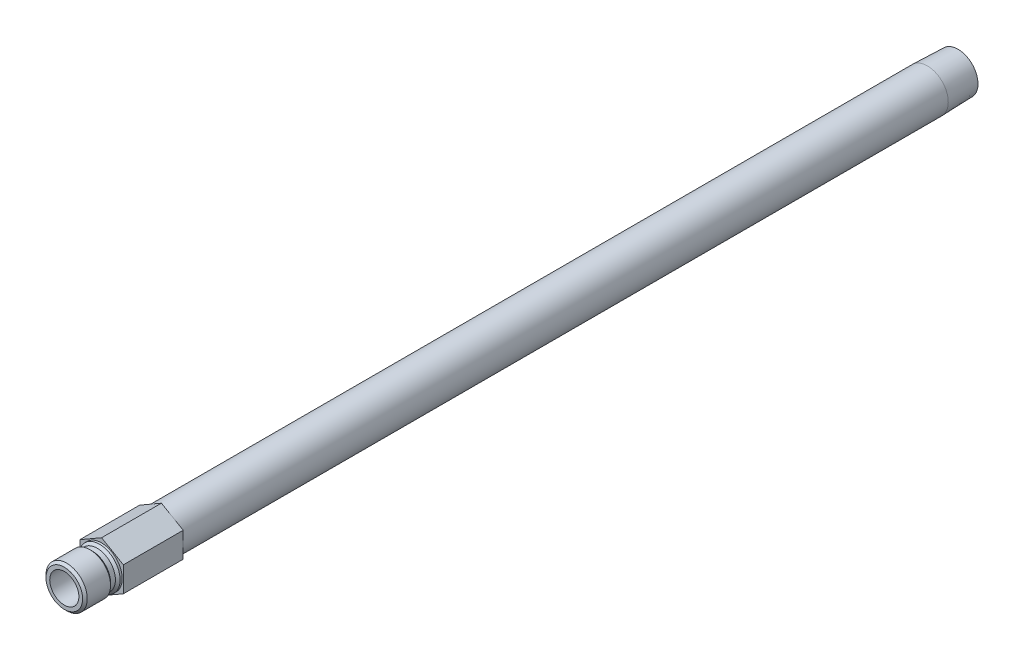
ISO-10303-21;
HEADER;
FILE_DESCRIPTION(('STEP AP214'),'2;1');
FILE_NAME('part.step','',(''),(''),'','','');
FILE_SCHEMA(('AUTOMOTIVE_DESIGN { 1 0 10303 214 1 1 1 1 }'));
ENDSEC;
DATA;
#1=APPLICATION_CONTEXT('core data for automotive mechanical design processes');
#2=APPLICATION_PROTOCOL_DEFINITION('international standard','automotive_design',2000,#1);
#3=PRODUCT_CONTEXT('',#1,'mechanical');
#4=PRODUCT('Part','Part','',(#3));
#5=PRODUCT_RELATED_PRODUCT_CATEGORY('part','',(#4));
#6=PRODUCT_DEFINITION_FORMATION('','',#4);
#7=PRODUCT_DEFINITION_CONTEXT('part definition',#1,'design');
#8=PRODUCT_DEFINITION('design','',#6,#7);
#9=PRODUCT_DEFINITION_SHAPE('','',#8);
#10=(LENGTH_UNIT() NAMED_UNIT(*) SI_UNIT(.MILLI.,.METRE.));
#11=(NAMED_UNIT(*) PLANE_ANGLE_UNIT() SI_UNIT($,.RADIAN.));
#12=(NAMED_UNIT(*) SI_UNIT($,.STERADIAN.) SOLID_ANGLE_UNIT());
#13=UNCERTAINTY_MEASURE_WITH_UNIT(LENGTH_MEASURE(1.E-05),#10,'distance_accuracy_value','');
#14=(GEOMETRIC_REPRESENTATION_CONTEXT(3) GLOBAL_UNCERTAINTY_ASSIGNED_CONTEXT((#13)) GLOBAL_UNIT_ASSIGNED_CONTEXT((#10,
#11,#12)) REPRESENTATION_CONTEXT('',''));
#15=CARTESIAN_POINT('',(0.,0.,0.));
#16=DIRECTION('',(0.,0.,1.));
#17=DIRECTION('',(1.,0.,0.));
#18=AXIS2_PLACEMENT_3D('',#15,#16,#17);
#19=CARTESIAN_POINT('',(0.,0.,0.));
#20=DIRECTION('',(0.,0.,-1.));
#21=DIRECTION('',(0.,1.,0.));
#22=AXIS2_PLACEMENT_3D('',#19,#20,#21);
#23=CYLINDRICAL_SURFACE('',#22,4.7625);
#24=CARTESIAN_POINT('',(0.,0.,0.));
#25=DIRECTION('',(0.,0.,1.));
#26=DIRECTION('',(1.,0.,0.));
#27=AXIS2_PLACEMENT_3D('',#24,#25,#26);
#28=CIRCLE('',#27,4.7625);
#29=CARTESIAN_POINT('',(4.7625,0.,0.));
#30=VERTEX_POINT('',#29);
#31=EDGE_CURVE('E138',#30,#30,#28,.T.);
#32=ORIENTED_EDGE('',*,*,#31,.F.);
#33=EDGE_LOOP('',(#32));
#34=FACE_BOUND('',#33,.T.);
#35=CARTESIAN_POINT('',(0.,0.,12.192));
#36=DIRECTION('',(0.,0.,-1.));
#37=DIRECTION('',(0.,1.,0.));
#38=AXIS2_PLACEMENT_3D('',#35,#36,#37);
#39=CIRCLE('',#38,4.7625);
#40=CARTESIAN_POINT('',(0.,4.7625,12.192));
#41=VERTEX_POINT('',#40);
#42=EDGE_CURVE('E11',#41,#41,#39,.T.);
#43=ORIENTED_EDGE('',*,*,#42,.F.);
#44=EDGE_LOOP('',(#43));
#45=FACE_BOUND('',#44,.T.);
#46=ADVANCED_FACE('F33',(#34,#45),#23,.F.);
#47=CARTESIAN_POINT('',(0.,4.7625,12.192));
#48=DIRECTION('',(0.,0.,1.));
#49=DIRECTION('',(0.,-1.,0.));
#50=AXIS2_PLACEMENT_3D('',#47,#48,#49);
#51=PLANE('',#50);
#52=ORIENTED_EDGE('',*,*,#42,.T.);
#53=EDGE_LOOP('',(#52));
#54=FACE_BOUND('',#53,.T.);
#55=CARTESIAN_POINT('',(0.,0.,12.192));
#56=DIRECTION('',(0.,0.,-1.));
#57=DIRECTION('',(0.,1.,0.));
#58=AXIS2_PLACEMENT_3D('',#55,#56,#57);
#59=CIRCLE('',#58,5.9817);
#60=CARTESIAN_POINT('',(0.,5.9817,12.192));
#61=VERTEX_POINT('',#60);
#62=EDGE_CURVE('E41',#61,#61,#59,.T.);
#63=ORIENTED_EDGE('',*,*,#62,.F.);
#64=EDGE_LOOP('',(#63));
#65=FACE_BOUND('',#64,.T.);
#66=ADVANCED_FACE('F181',(#54,#65),#51,.T.);
#67=CARTESIAN_POINT('',(0.,0.,11.43));
#68=DIRECTION('',(0.,0.,-1.));
#69=DIRECTION('',(0.,1.,0.));
#70=AXIS2_PLACEMENT_3D('',#67,#68,#69);
#71=CONICAL_SURFACE('',#70,6.7437,0.785398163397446);
#72=ORIENTED_EDGE('',*,*,#62,.T.);
#73=EDGE_LOOP('',(#72));
#74=FACE_BOUND('',#73,.T.);
#75=CARTESIAN_POINT('',(0.,0.,11.43));
#76=DIRECTION('',(0.,0.,-1.));
#77=DIRECTION('',(0.,1.,0.));
#78=AXIS2_PLACEMENT_3D('',#75,#76,#77);
#79=CIRCLE('',#78,6.7437);
#80=CARTESIAN_POINT('',(0.,6.7437,11.43));
#81=VERTEX_POINT('',#80);
#82=EDGE_CURVE('E173',#81,#81,#79,.T.);
#83=ORIENTED_EDGE('',*,*,#82,.F.);
#84=EDGE_LOOP('',(#83));
#85=FACE_BOUND('',#84,.T.);
#86=ADVANCED_FACE('F178',(#74,#85),#71,.T.);
#87=CARTESIAN_POINT('',(0.,0.,0.));
#88=DIRECTION('',(0.,0.,-1.));
#89=DIRECTION('',(0.,1.,0.));
#90=AXIS2_PLACEMENT_3D('',#87,#88,#89);
#91=CYLINDRICAL_SURFACE('',#90,6.7437);
#92=ORIENTED_EDGE('',*,*,#82,.T.);
#93=EDGE_LOOP('',(#92));
#94=FACE_BOUND('',#93,.T.);
#95=CARTESIAN_POINT('',(0.,0.,3.81));
#96=DIRECTION('',(0.,0.,-1.));
#97=DIRECTION('',(0.,1.,0.));
#98=AXIS2_PLACEMENT_3D('',#95,#96,#97);
#99=CIRCLE('',#98,6.7437);
#100=CARTESIAN_POINT('',(0.,6.7437,3.81));
#101=VERTEX_POINT('',#100);
#102=EDGE_CURVE('E170',#101,#101,#99,.T.);
#103=ORIENTED_EDGE('',*,*,#102,.F.);
#104=EDGE_LOOP('',(#103));
#105=FACE_BOUND('',#104,.T.);
#106=ADVANCED_FACE('F188',(#94,#105),#91,.T.);
#107=CARTESIAN_POINT('',(0.,0.,3.048));
#108=DIRECTION('',(0.,0.,1.));
#109=DIRECTION('',(0.,-1.,0.));
#110=AXIS2_PLACEMENT_3D('',#107,#108,#109);
#111=CONICAL_SURFACE('',#110,5.9817,0.785398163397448);
#112=ORIENTED_EDGE('',*,*,#102,.T.);
#113=EDGE_LOOP('',(#112));
#114=FACE_BOUND('',#113,.T.);
#115=CARTESIAN_POINT('',(0.,0.,3.048));
#116=DIRECTION('',(0.,0.,-1.));
#117=DIRECTION('',(0.,1.,0.));
#118=AXIS2_PLACEMENT_3D('',#115,#116,#117);
#119=CIRCLE('',#118,5.9817);
#120=CARTESIAN_POINT('',(0.,5.9817,3.048));
#121=VERTEX_POINT('',#120);
#122=EDGE_CURVE('E167',#121,#121,#119,.T.);
#123=ORIENTED_EDGE('',*,*,#122,.F.);
#124=EDGE_LOOP('',(#123));
#125=FACE_BOUND('',#124,.T.);
#126=ADVANCED_FACE('F194',(#114,#125),#111,.T.);
#127=CARTESIAN_POINT('',(0.,0.,0.));
#128=DIRECTION('',(0.,0.,-1.));
#129=DIRECTION('',(0.,1.,0.));
#130=AXIS2_PLACEMENT_3D('',#127,#128,#129);
#131=CYLINDRICAL_SURFACE('',#130,5.9817);
#132=ORIENTED_EDGE('',*,*,#122,.T.);
#133=EDGE_LOOP('',(#132));
#134=FACE_BOUND('',#133,.T.);
#135=CARTESIAN_POINT('',(0.,0.,1.4605));
#136=DIRECTION('',(0.,0.,-1.));
#137=DIRECTION('',(0.,1.,0.));
#138=AXIS2_PLACEMENT_3D('',#135,#136,#137);
#139=CIRCLE('',#138,5.9817);
#140=CARTESIAN_POINT('',(0.,5.9817,1.4605));
#141=VERTEX_POINT('',#140);
#142=EDGE_CURVE('E164',#141,#141,#139,.T.);
#143=ORIENTED_EDGE('',*,*,#142,.F.);
#144=EDGE_LOOP('',(#143));
#145=FACE_BOUND('',#144,.T.);
#146=ADVANCED_FACE('F198',(#134,#145),#131,.T.);
#147=CARTESIAN_POINT('',(0.,0.,0.698499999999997));
#148=DIRECTION('',(0.,0.,-1.));
#149=DIRECTION('',(0.,1.,0.));
#150=AXIS2_PLACEMENT_3D('',#147,#148,#149);
#151=CONICAL_SURFACE('',#150,6.7437,0.785398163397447);
#152=ORIENTED_EDGE('',*,*,#142,.T.);
#153=EDGE_LOOP('',(#152));
#154=FACE_BOUND('',#153,.T.);
#155=CARTESIAN_POINT('',(0.,0.,0.698499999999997));
#156=DIRECTION('',(0.,0.,-1.));
#157=DIRECTION('',(0.,1.,0.));
#158=AXIS2_PLACEMENT_3D('',#155,#156,#157);
#159=CIRCLE('',#158,6.7437);
#160=CARTESIAN_POINT('',(0.,6.7437,0.698499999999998));
#161=VERTEX_POINT('',#160);
#162=EDGE_CURVE('E161',#161,#161,#159,.T.);
#163=ORIENTED_EDGE('',*,*,#162,.F.);
#164=EDGE_LOOP('',(#163));
#165=FACE_BOUND('',#164,.T.);
#166=ADVANCED_FACE('F202',(#154,#165),#151,.T.);
#167=CARTESIAN_POINT('',(0.,0.,0.));
#168=DIRECTION('',(0.,0.,-1.));
#169=DIRECTION('',(0.,1.,0.));
#170=AXIS2_PLACEMENT_3D('',#167,#168,#169);
#171=CYLINDRICAL_SURFACE('',#170,6.7437);
#172=ORIENTED_EDGE('',*,*,#162,.T.);
#173=EDGE_LOOP('',(#172));
#174=FACE_BOUND('',#173,.T.);
#175=CARTESIAN_POINT('',(0.,0.,0.));
#176=DIRECTION('',(0.,0.,-1.));
#177=DIRECTION('',(0.,1.,0.));
#178=AXIS2_PLACEMENT_3D('',#175,#176,#177);
#179=CIRCLE('',#178,6.7437);
#180=CARTESIAN_POINT('',(0.,6.7437,0.));
#181=VERTEX_POINT('',#180);
#182=EDGE_CURVE('E158',#181,#181,#179,.T.);
#183=ORIENTED_EDGE('',*,*,#182,.F.);
#184=EDGE_LOOP('',(#183));
#185=FACE_BOUND('',#184,.T.);
#186=ADVANCED_FACE('F206',(#174,#185),#171,.T.);
#187=CARTESIAN_POINT('',(0.,6.7437,0.));
#188=DIRECTION('',(0.,0.,1.));
#189=DIRECTION('',(0.,-1.,0.));
#190=AXIS2_PLACEMENT_3D('',#187,#188,#189);
#191=PLANE('',#190);
#192=ORIENTED_EDGE('',*,*,#182,.T.);
#193=EDGE_LOOP('',(#192));
#194=FACE_BOUND('',#193,.T.);
#195=DIRECTION('',(-0.866025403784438,-0.5,0.));
#196=VECTOR('',#195,1.);
#197=CARTESIAN_POINT('',(0.,8.21223022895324,0.));
#198=LINE('',#197,#196);
#199=CARTESIAN_POINT('',(0.,8.21223022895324,0.));
#200=VERTEX_POINT('',#199);
#201=CARTESIAN_POINT('',(-7.112,4.10611511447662,0.));
#202=VERTEX_POINT('',#201);
#203=EDGE_CURVE('E120',#200,#202,#198,.T.);
#204=ORIENTED_EDGE('',*,*,#203,.T.);
#205=DIRECTION('',(0.,-1.,0.));
#206=VECTOR('',#205,1.);
#207=CARTESIAN_POINT('',(-7.112,4.10611511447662,0.));
#208=LINE('',#207,#206);
#209=CARTESIAN_POINT('',(-7.112,-4.10611511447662,0.));
#210=VERTEX_POINT('',#209);
#211=EDGE_CURVE('E123',#202,#210,#208,.T.);
#212=ORIENTED_EDGE('',*,*,#211,.T.);
#213=DIRECTION('',(0.866025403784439,-0.5,0.));
#214=VECTOR('',#213,1.);
#215=CARTESIAN_POINT('',(-7.112,-4.10611511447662,0.));
#216=LINE('',#215,#214);
#217=CARTESIAN_POINT('',(0.,-8.21223022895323,0.));
#218=VERTEX_POINT('',#217);
#219=EDGE_CURVE('E127',#210,#218,#216,.T.);
#220=ORIENTED_EDGE('',*,*,#219,.T.);
#221=DIRECTION('',(0.866025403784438,0.5,0.));
#222=VECTOR('',#221,1.);
#223=CARTESIAN_POINT('',(0.,-8.21223022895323,0.));
#224=LINE('',#223,#222);
#225=CARTESIAN_POINT('',(7.112,-4.10611511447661,0.));
#226=VERTEX_POINT('',#225);
#227=EDGE_CURVE('E130',#218,#226,#224,.T.);
#228=ORIENTED_EDGE('',*,*,#227,.T.);
#229=DIRECTION('',(0.,1.,0.));
#230=VECTOR('',#229,1.);
#231=CARTESIAN_POINT('',(7.112,-4.10611511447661,0.));
#232=LINE('',#231,#230);
#233=CARTESIAN_POINT('',(7.112,4.10611511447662,0.));
#234=VERTEX_POINT('',#233);
#235=EDGE_CURVE('E97',#226,#234,#232,.T.);
#236=ORIENTED_EDGE('',*,*,#235,.T.);
#237=DIRECTION('',(-0.866025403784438,0.5,0.));
#238=VECTOR('',#237,1.);
#239=CARTESIAN_POINT('',(7.112,4.10611511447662,0.));
#240=LINE('',#239,#238);
#241=EDGE_CURVE('E133',#234,#200,#240,.T.);
#242=ORIENTED_EDGE('',*,*,#241,.T.);
#243=EDGE_LOOP('',(#204,#212,#220,#228,#236,#242));
#244=FACE_BOUND('',#243,.T.);
#245=ADVANCED_FACE('F210',(#194,#244),#191,.T.);
#246=CARTESIAN_POINT('',(-7.112,4.10611511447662,0.));
#247=DIRECTION('',(0.,0.,1.));
#248=DIRECTION('',(1.,0.,0.));
#249=AXIS2_PLACEMENT_3D('',#246,#247,#248);
#250=PLANE('',#249);
#251=ORIENTED_EDGE('',*,*,#31,.T.);
#252=EDGE_LOOP('',(#251));
#253=FACE_BOUND('',#252,.T.);
#254=CARTESIAN_POINT('',(0.,0.,0.));
#255=DIRECTION('',(0.,0.,1.));
#256=DIRECTION('',(1.,0.,0.));
#257=AXIS2_PLACEMENT_3D('',#254,#255,#256);
#258=CIRCLE('',#257,4.62279999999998);
#259=CARTESIAN_POINT('',(4.62279999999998,0.,0.));
#260=VERTEX_POINT('',#259);
#261=EDGE_CURVE('E124',#260,#260,#258,.T.);
#262=ORIENTED_EDGE('',*,*,#261,.F.);
#263=EDGE_LOOP('',(#262));
#264=FACE_BOUND('',#263,.T.);
#265=ADVANCED_FACE('F214',(#253,#264),#250,.T.);
#266=CARTESIAN_POINT('',(0.,0.,-279.908));
#267=DIRECTION('',(0.,0.,1.));
#268=DIRECTION('',(0.,-1.,0.));
#269=AXIS2_PLACEMENT_3D('',#266,#267,#268);
#270=CONICAL_SURFACE('',#269,6.54447060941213,0.0312396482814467);
#271=CARTESIAN_POINT('',(0.,0.,-269.875));
#272=DIRECTION('',(0.,0.,-1.));
#273=DIRECTION('',(0.,1.,0.));
#274=AXIS2_PLACEMENT_3D('',#271,#272,#273);
#275=CIRCLE('',#274,6.85799999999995);
#276=CARTESIAN_POINT('',(0.,6.858,-269.875));
#277=VERTEX_POINT('',#276);
#278=EDGE_CURVE('E155',#277,#277,#275,.T.);
#279=ORIENTED_EDGE('',*,*,#278,.T.);
#280=EDGE_LOOP('',(#279));
#281=FACE_BOUND('',#280,.T.);
#282=CARTESIAN_POINT('',(0.,0.,-279.908));
#283=DIRECTION('',(0.,0.,-1.));
#284=DIRECTION('',(0.,1.,0.));
#285=AXIS2_PLACEMENT_3D('',#282,#283,#284);
#286=CIRCLE('',#285,6.54447060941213);
#287=CARTESIAN_POINT('',(0.,6.54447060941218,-279.908));
#288=VERTEX_POINT('',#287);
#289=EDGE_CURVE('E152',#288,#288,#286,.T.);
#290=ORIENTED_EDGE('',*,*,#289,.F.);
#291=EDGE_LOOP('',(#290));
#292=FACE_BOUND('',#291,.T.);
#293=ADVANCED_FACE('F220',(#281,#292),#270,.T.);
#294=CARTESIAN_POINT('',(0.,0.,0.));
#295=DIRECTION('',(0.,0.,-1.));
#296=DIRECTION('',(0.,1.,0.));
#297=AXIS2_PLACEMENT_3D('',#294,#295,#296);
#298=CYLINDRICAL_SURFACE('',#297,6.85799999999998);
#299=ORIENTED_EDGE('',*,*,#278,.F.);
#300=EDGE_LOOP('',(#299));
#301=FACE_BOUND('',#300,.T.);
#302=CARTESIAN_POINT('',(0.,0.,-19.558));
#303=DIRECTION('',(0.,0.,1.));
#304=DIRECTION('',(1.,0.,0.));
#305=AXIS2_PLACEMENT_3D('',#302,#303,#304);
#306=CIRCLE('',#305,6.85799999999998);
#307=CARTESIAN_POINT('',(6.85799999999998,0.,-19.558));
#308=VERTEX_POINT('',#307);
#309=EDGE_CURVE('E146',#308,#308,#306,.F.);
#310=ORIENTED_EDGE('',*,*,#309,.T.);
#311=EDGE_LOOP('',(#310));
#312=FACE_BOUND('',#311,.T.);
#313=ADVANCED_FACE('F216',(#301,#312),#298,.T.);
#314=CARTESIAN_POINT('',(0.,6.54447060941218,-279.908));
#315=DIRECTION('',(0.,0.,-1.));
#316=DIRECTION('',(0.,1.,0.));
#317=AXIS2_PLACEMENT_3D('',#314,#315,#316);
#318=PLANE('',#317);
#319=ORIENTED_EDGE('',*,*,#289,.T.);
#320=EDGE_LOOP('',(#319));
#321=FACE_BOUND('',#320,.T.);
#322=CARTESIAN_POINT('',(0.,0.,-279.908));
#323=DIRECTION('',(0.,0.,-1.));
#324=DIRECTION('',(0.,1.,0.));
#325=AXIS2_PLACEMENT_3D('',#322,#323,#324);
#326=CIRCLE('',#325,4.62279999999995);
#327=CARTESIAN_POINT('',(0.,4.6228,-279.908));
#328=VERTEX_POINT('',#327);
#329=EDGE_CURVE('E149',#328,#328,#326,.T.);
#330=ORIENTED_EDGE('',*,*,#329,.F.);
#331=EDGE_LOOP('',(#330));
#332=FACE_BOUND('',#331,.T.);
#333=ADVANCED_FACE('F219',(#321,#332),#318,.T.);
#334=CARTESIAN_POINT('',(0.,0.,0.));
#335=DIRECTION('',(0.,0.,-1.));
#336=DIRECTION('',(0.,1.,0.));
#337=AXIS2_PLACEMENT_3D('',#334,#335,#336);
#338=CYLINDRICAL_SURFACE('',#337,4.62279999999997);
#339=ORIENTED_EDGE('',*,*,#261,.T.);
#340=EDGE_LOOP('',(#339));
#341=FACE_BOUND('',#340,.T.);
#342=ORIENTED_EDGE('',*,*,#329,.T.);
#343=EDGE_LOOP('',(#342));
#344=FACE_BOUND('',#343,.T.);
#345=ADVANCED_FACE('F227',(#341,#344),#338,.F.);
#346=CARTESIAN_POINT('',(0.,8.21223022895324,-19.558));
#347=DIRECTION('',(-0.5,0.866025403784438,0.));
#348=DIRECTION('',(-0.866025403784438,-0.5,0.));
#349=AXIS2_PLACEMENT_3D('',#346,#347,#348);
#350=PLANE('',#349);
#351=ORIENTED_EDGE('',*,*,#203,.F.);
#352=DIRECTION('',(0.,0.,1.));
#353=VECTOR('',#352,1.);
#354=CARTESIAN_POINT('',(0.,8.21223022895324,-19.558));
#355=LINE('',#354,#353);
#356=CARTESIAN_POINT('',(0.,8.21223022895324,-19.558));
#357=VERTEX_POINT('',#356);
#358=EDGE_CURVE('E49',#357,#200,#355,.T.);
#359=ORIENTED_EDGE('',*,*,#358,.F.);
#360=DIRECTION('',(-0.866025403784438,-0.5,0.));
#361=VECTOR('',#360,1.);
#362=CARTESIAN_POINT('',(0.,8.21223022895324,-19.558));
#363=LINE('',#362,#361);
#364=CARTESIAN_POINT('',(-7.112,4.10611511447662,-19.558));
#365=VERTEX_POINT('',#364);
#366=EDGE_CURVE('E136',#357,#365,#363,.T.);
#367=ORIENTED_EDGE('',*,*,#366,.T.);
#368=DIRECTION('',(0.,0.,1.));
#369=VECTOR('',#368,1.);
#370=CARTESIAN_POINT('',(-7.112,4.10611511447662,-19.558));
#371=LINE('',#370,#369);
#372=EDGE_CURVE('E84',#365,#202,#371,.T.);
#373=ORIENTED_EDGE('',*,*,#372,.T.);
#374=EDGE_LOOP('',(#351,#359,#367,#373));
#375=FACE_BOUND('',#374,.T.);
#376=ADVANCED_FACE('F231',(#375),#350,.T.);
#377=CARTESIAN_POINT('',(7.112,4.10611511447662,-19.558));
#378=DIRECTION('',(0.5,0.866025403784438,0.));
#379=DIRECTION('',(-0.866025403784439,0.5,0.));
#380=AXIS2_PLACEMENT_3D('',#377,#378,#379);
#381=PLANE('',#380);
#382=ORIENTED_EDGE('',*,*,#241,.F.);
#383=DIRECTION('',(0.,0.,1.));
#384=VECTOR('',#383,1.);
#385=CARTESIAN_POINT('',(7.112,4.10611511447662,-19.558));
#386=LINE('',#385,#384);
#387=CARTESIAN_POINT('',(7.112,4.10611511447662,-19.558));
#388=VERTEX_POINT('',#387);
#389=EDGE_CURVE('E72',#388,#234,#386,.T.);
#390=ORIENTED_EDGE('',*,*,#389,.F.);
#391=DIRECTION('',(-0.866025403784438,0.5,0.));
#392=VECTOR('',#391,1.);
#393=CARTESIAN_POINT('',(7.112,4.10611511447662,-19.558));
#394=LINE('',#393,#392);
#395=EDGE_CURVE('E110',#388,#357,#394,.T.);
#396=ORIENTED_EDGE('',*,*,#395,.T.);
#397=ORIENTED_EDGE('',*,*,#358,.T.);
#398=EDGE_LOOP('',(#382,#390,#396,#397));
#399=FACE_BOUND('',#398,.T.);
#400=ADVANCED_FACE('F235',(#399),#381,.T.);
#401=CARTESIAN_POINT('',(7.112,-4.10611511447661,-19.558));
#402=DIRECTION('',(1.,0.,0.));
#403=DIRECTION('',(0.,1.,0.));
#404=AXIS2_PLACEMENT_3D('',#401,#402,#403);
#405=PLANE('',#404);
#406=ORIENTED_EDGE('',*,*,#235,.F.);
#407=DIRECTION('',(0.,0.,1.));
#408=VECTOR('',#407,1.);
#409=CARTESIAN_POINT('',(7.112,-4.10611511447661,-19.558));
#410=LINE('',#409,#408);
#411=CARTESIAN_POINT('',(7.112,-4.10611511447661,-19.558));
#412=VERTEX_POINT('',#411);
#413=EDGE_CURVE('E92',#412,#226,#410,.T.);
#414=ORIENTED_EDGE('',*,*,#413,.F.);
#415=DIRECTION('',(0.,1.,0.));
#416=VECTOR('',#415,1.);
#417=CARTESIAN_POINT('',(7.112,-4.10611511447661,-19.558));
#418=LINE('',#417,#416);
#419=EDGE_CURVE('E95',#412,#388,#418,.T.);
#420=ORIENTED_EDGE('',*,*,#419,.T.);
#421=ORIENTED_EDGE('',*,*,#389,.T.);
#422=EDGE_LOOP('',(#406,#414,#420,#421));
#423=FACE_BOUND('',#422,.T.);
#424=ADVANCED_FACE('F94',(#423),#405,.T.);
#425=CARTESIAN_POINT('',(0.,-8.21223022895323,-19.558));
#426=DIRECTION('',(0.5,-0.866025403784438,0.));
#427=DIRECTION('',(0.866025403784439,0.5,0.));
#428=AXIS2_PLACEMENT_3D('',#425,#426,#427);
#429=PLANE('',#428);
#430=ORIENTED_EDGE('',*,*,#227,.F.);
#431=DIRECTION('',(0.,0.,1.));
#432=VECTOR('',#431,1.);
#433=CARTESIAN_POINT('',(0.,-8.21223022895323,-19.558));
#434=LINE('',#433,#432);
#435=CARTESIAN_POINT('',(0.,-8.21223022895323,-19.558));
#436=VERTEX_POINT('',#435);
#437=EDGE_CURVE('E102',#436,#218,#434,.T.);
#438=ORIENTED_EDGE('',*,*,#437,.F.);
#439=DIRECTION('',(0.866025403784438,0.5,0.));
#440=VECTOR('',#439,1.);
#441=CARTESIAN_POINT('',(0.,-8.21223022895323,-19.558));
#442=LINE('',#441,#440);
#443=EDGE_CURVE('E108',#436,#412,#442,.T.);
#444=ORIENTED_EDGE('',*,*,#443,.T.);
#445=ORIENTED_EDGE('',*,*,#413,.T.);
#446=EDGE_LOOP('',(#430,#438,#444,#445));
#447=FACE_BOUND('',#446,.T.);
#448=ADVANCED_FACE('F112',(#447),#429,.T.);
#449=CARTESIAN_POINT('',(-7.112,-4.10611511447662,-19.558));
#450=DIRECTION('',(-0.5,-0.866025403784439,0.));
#451=DIRECTION('',(0.866025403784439,-0.5,0.));
#452=AXIS2_PLACEMENT_3D('',#449,#450,#451);
#453=PLANE('',#452);
#454=ORIENTED_EDGE('',*,*,#219,.F.);
#455=DIRECTION('',(0.,0.,1.));
#456=VECTOR('',#455,1.);
#457=CARTESIAN_POINT('',(-7.112,-4.10611511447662,-19.558));
#458=LINE('',#457,#456);
#459=CARTESIAN_POINT('',(-7.112,-4.10611511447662,-19.558));
#460=VERTEX_POINT('',#459);
#461=EDGE_CURVE('E141',#460,#210,#458,.T.);
#462=ORIENTED_EDGE('',*,*,#461,.F.);
#463=DIRECTION('',(0.866025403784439,-0.5,0.));
#464=VECTOR('',#463,1.);
#465=CARTESIAN_POINT('',(-7.112,-4.10611511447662,-19.558));
#466=LINE('',#465,#464);
#467=EDGE_CURVE('E113',#460,#436,#466,.T.);
#468=ORIENTED_EDGE('',*,*,#467,.T.);
#469=ORIENTED_EDGE('',*,*,#437,.T.);
#470=EDGE_LOOP('',(#454,#462,#468,#469));
#471=FACE_BOUND('',#470,.T.);
#472=ADVANCED_FACE('F239',(#471),#453,.T.);
#473=CARTESIAN_POINT('',(-7.112,4.10611511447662,-19.558));
#474=DIRECTION('',(-1.,0.,0.));
#475=DIRECTION('',(0.,-1.,0.));
#476=AXIS2_PLACEMENT_3D('',#473,#474,#475);
#477=PLANE('',#476);
#478=ORIENTED_EDGE('',*,*,#211,.F.);
#479=ORIENTED_EDGE('',*,*,#372,.F.);
#480=DIRECTION('',(0.,-1.,0.));
#481=VECTOR('',#480,1.);
#482=CARTESIAN_POINT('',(-7.112,4.10611511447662,-19.558));
#483=LINE('',#482,#481);
#484=EDGE_CURVE('E115',#365,#460,#483,.T.);
#485=ORIENTED_EDGE('',*,*,#484,.T.);
#486=ORIENTED_EDGE('',*,*,#461,.T.);
#487=EDGE_LOOP('',(#478,#479,#485,#486));
#488=FACE_BOUND('',#487,.T.);
#489=ADVANCED_FACE('F236',(#488),#477,.T.);
#490=CARTESIAN_POINT('',(-7.112,4.10611511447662,-19.558));
#491=DIRECTION('',(0.,0.,1.));
#492=DIRECTION('',(1.,0.,0.));
#493=AXIS2_PLACEMENT_3D('',#490,#491,#492);
#494=PLANE('',#493);
#495=ORIENTED_EDGE('',*,*,#309,.F.);
#496=EDGE_LOOP('',(#495));
#497=FACE_BOUND('',#496,.T.);
#498=ORIENTED_EDGE('',*,*,#366,.F.);
#499=ORIENTED_EDGE('',*,*,#395,.F.);
#500=ORIENTED_EDGE('',*,*,#419,.F.);
#501=ORIENTED_EDGE('',*,*,#443,.F.);
#502=ORIENTED_EDGE('',*,*,#467,.F.);
#503=ORIENTED_EDGE('',*,*,#484,.F.);
#504=EDGE_LOOP('',(#498,#499,#500,#501,#502,#503));
#505=FACE_BOUND('',#504,.T.);
#506=ADVANCED_FACE('F106',(#497,#505),#494,.F.);
#507=CLOSED_SHELL('',(#46,#66,#86,#106,#126,#146,#166,#186,#245,#265,#293,#313,#333,#345,#376,
#400,#424,#448,#472,#489,#506));
#508=MANIFOLD_SOLID_BREP('B2',#507);
#509=ADVANCED_BREP_SHAPE_REPRESENTATION('',(#18,#508),#14);
#510=SHAPE_DEFINITION_REPRESENTATION(#9,#509);
ENDSEC;
END-ISO-10303-21;
